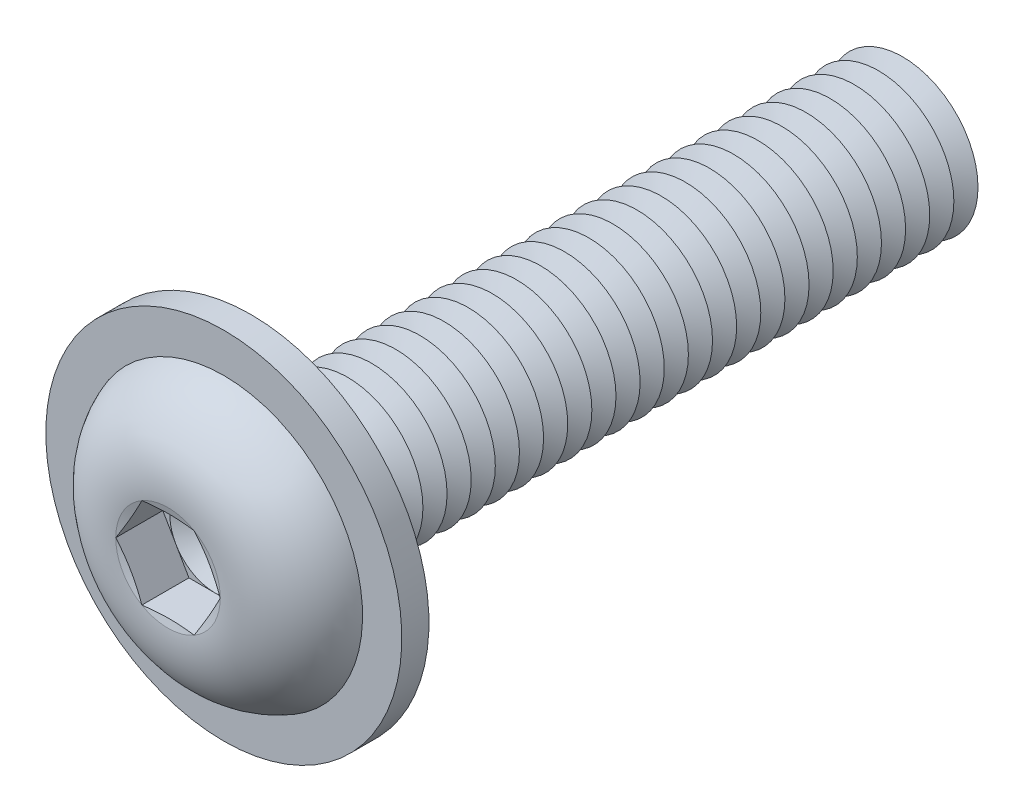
from build123d import *

# Parameters (mm, degrees)
FILLET1_R           = 0.4
LPATTERN1_COUNT     = 27
LPATTERN1_PITCH     = 0.8
CUT_EXTRUDE1_DEPTH  = 1.56
SKETCH5_R           = 5.9
SKETCH5_R_2         = 2.9
BOSS_EXTRUDE1_DEPTH = 0.9


with BuildPart() as part:
    # Sketch1 → Revolve1 (revolve)
    with BuildSketch(Plane(origin=(0, 0, 0), x_dir=(0, 0, -1), z_dir=(1, 0, 0)), mode=Mode.PRIVATE) as revolve1_sk:
        with BuildLine():
            Line((0, 2.5), (0, 4.75))
            ThreePointArc((0, 4.75), (-2.041477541, 3.848329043), (-2.75, 1.73205))
            Line((-2.75, 1.73205), (-2.517949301, 0.866025))
            Line((-2.517949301, 0.866025), (-2.75, 0.866025))
            Line((-2.75, 0.866025), (-2.75, 0))
            Line((-2.75, 0), (22, 0))
            Line((22, 0), (22, 2.5))
            Line((22, 2.5), (0, 2.5))
        make_face()
    revolve(revolve1_sk.sketch.rotate(Axis((0, 0, -22), (0, 0, 1)), 90), axis=Axis((0, 0, -22), (0, 0, 1)))

    # Fillet1
    fillet1_edges = [part.edges().sort_by_distance(p)[0] for p in [
        (2.5, 0, 0),
    ]]
    fillet(fillet1_edges, radius=FILLET1_R)

    # Sketch2 → Cut-Revolve1 (revolve, cut)
    with BuildSketch(Plane(origin=(0, 0, 0), x_dir=(0, 0, -1), z_dir=(1, 0, 0)), mode=Mode.PRIVATE) as cut_revolve1_sk:
        Polygon((21.6, 2.5), (22.4, 2.5), (22, 1.807179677), align=None)
    cut_revolve1 = revolve(cut_revolve1_sk.sketch.rotate(Axis((0, 0, -22), (0, 0, -1)), 270), axis=Axis((0, 0, -22), (0, 0, -1)), mode=Mode.SUBTRACT)

    # LPattern1: Cut-Revolve1 ×27
    with Locations(*[(0, 0, i * LPATTERN1_PITCH) for i in range(1, LPATTERN1_COUNT)]):
        add(cut_revolve1, mode=Mode.SUBTRACT)

    # Sketch3 → Cut-Extrude1 (cut)
    with BuildSketch(Plane.XY.offset(2.75)):
        Polygon((0.866025, 1.499999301), (-0.866025, 1.499999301), (-1.73205, 0), (-0.866025, -1.499999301), (0.866025, -1.499999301), (1.73205, 0), align=None)
    extrude(amount=-CUT_EXTRUDE1_DEPTH, mode=Mode.SUBTRACT)

    # Cut-Extrude2 cone 1 section (on through the dimple's axis) → Cut-Extrude2 (revolve, cut)
    with BuildSketch(Plane(origin=(0, 0, 1.19), x_dir=(0, -1, 0), z_dir=(1, 0, 0))):
        Polygon((0, 0), (1.499999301, 0), (0, 0.866025), align=None)
    revolve(axis=Axis((0, 0, 1.19), (0, 0, -1)), mode=Mode.SUBTRACT)

    # Sketch5 → Boss-Extrude1 (add)
    with BuildSketch(Plane(origin=(0, 0, 0), x_dir=(-1, 0, 0), z_dir=(0, 0, -1))):
        with Locations(Location((0, 0, 0), (0, 0, 90))):
            Circle(SKETCH5_R)
        Circle(SKETCH5_R_2, mode=Mode.SUBTRACT)
    extrude(amount=-BOSS_EXTRUDE1_DEPTH)


solid = part.part
